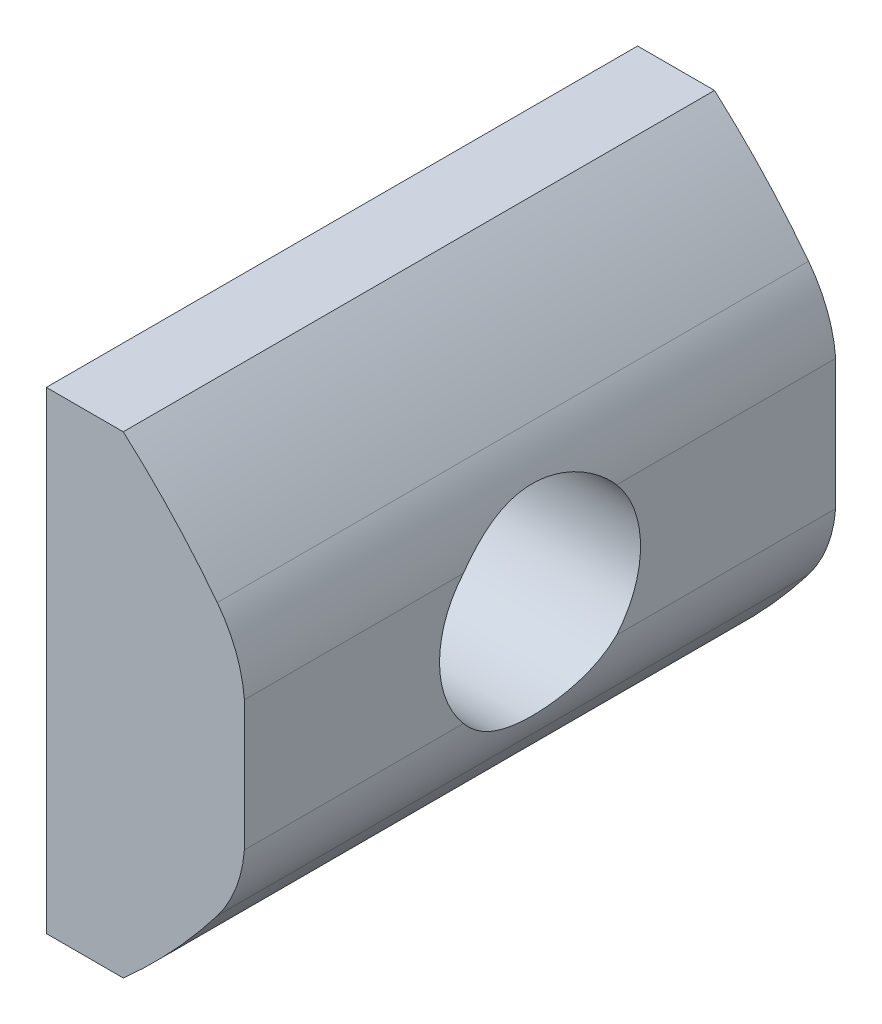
from build123d import *

# Parameters (mm, degrees)
EXTRUSION1_DEPTH       = 10
CHANFREIN1_SIZE        = 0.3
TROU_TARAUD_M8X1_252_D = 6.8


with BuildPart() as part:
    # Esquisse1 → Extrusion1 (new, symmetric)
    with BuildSketch(Plane.XY):
        with BuildLine():
            Line((4, 2.2), (4, -2.2))
            ThreePointArc((4, -2.2), (3.714708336, -3.459776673), (3.08330765, -4.586613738))
            ThreePointArc((3.08330765, -4.586613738), (1.574422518, -6.369191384), (-0.097337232, -8))
            Line((-0.097337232, -8), (-3, -8))
            Line((-3, -8), (-3, 8))
            Line((-3, 8), (-0.097337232, 8))
            ThreePointArc((-0.097337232, 8), (1.574422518, 6.369191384), (3.08330765, 4.586613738))
            ThreePointArc((3.08330765, 4.586613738), (3.714708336, 3.459776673), (4, 2.2))
        make_face()
    extrude(amount=EXTRUSION1_DEPTH, both=True)

    # Chanfrein1
    chanfrein1_edges = [part.edges().sort_by_distance(p)[0] for p in [
        (-3, 0, 10),
        (-3, 8, 0),
        (-3, 0, -10),
        (-3, -8, 0),
    ]]
    chamfer(chanfrein1_edges, length=CHANFREIN1_SIZE)

    # Trou taraud_ M8x1.252 (through all)
    with Locations(Plane.ZY.offset(3)):
        with Locations((0, 0)):
            Hole(TROU_TARAUD_M8X1_252_D / 2)


solid = part.part
